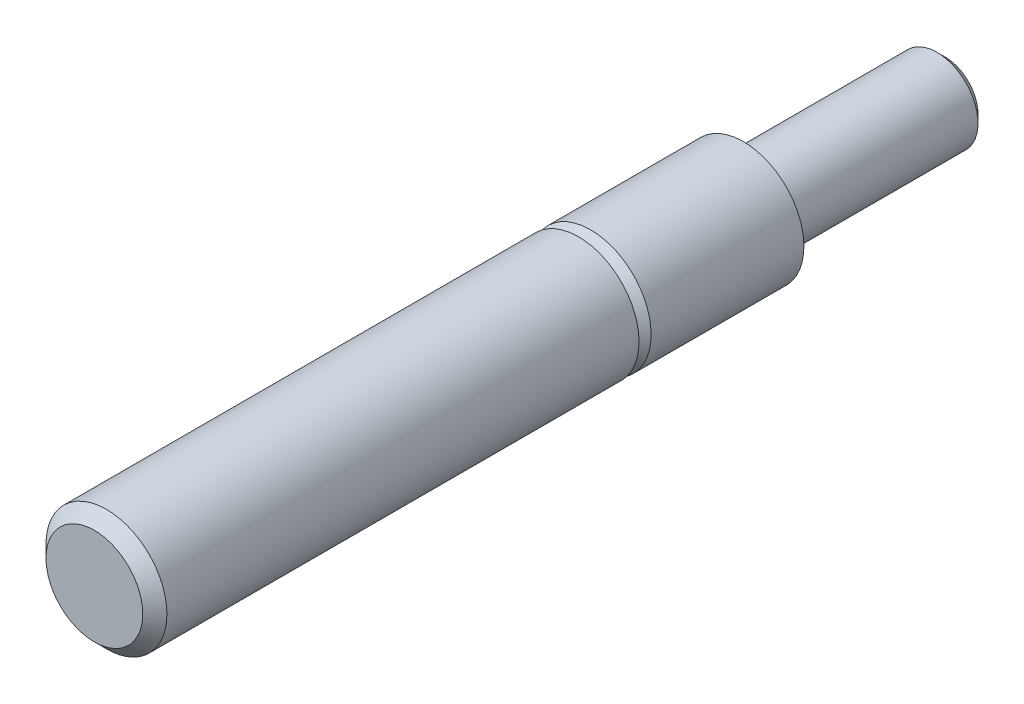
ISO-10303-21;
HEADER;
FILE_DESCRIPTION(('STEP AP214'),'2;1');
FILE_NAME('part.step','',(''),(''),'','','');
FILE_SCHEMA(('AUTOMOTIVE_DESIGN { 1 0 10303 214 1 1 1 1 }'));
ENDSEC;
DATA;
#1=APPLICATION_CONTEXT('core data for automotive mechanical design processes');
#2=APPLICATION_PROTOCOL_DEFINITION('international standard','automotive_design',2000,#1);
#3=PRODUCT_CONTEXT('',#1,'mechanical');
#4=PRODUCT('Part','Part','',(#3));
#5=PRODUCT_RELATED_PRODUCT_CATEGORY('part','',(#4));
#6=PRODUCT_DEFINITION_FORMATION('','',#4);
#7=PRODUCT_DEFINITION_CONTEXT('part definition',#1,'design');
#8=PRODUCT_DEFINITION('design','',#6,#7);
#9=PRODUCT_DEFINITION_SHAPE('','',#8);
#10=(LENGTH_UNIT() NAMED_UNIT(*) SI_UNIT(.MILLI.,.METRE.));
#11=(NAMED_UNIT(*) PLANE_ANGLE_UNIT() SI_UNIT($,.RADIAN.));
#12=(NAMED_UNIT(*) SI_UNIT($,.STERADIAN.) SOLID_ANGLE_UNIT());
#13=UNCERTAINTY_MEASURE_WITH_UNIT(LENGTH_MEASURE(1.E-05),#10,'distance_accuracy_value','');
#14=(GEOMETRIC_REPRESENTATION_CONTEXT(3) GLOBAL_UNCERTAINTY_ASSIGNED_CONTEXT((#13)) GLOBAL_UNIT_ASSIGNED_CONTEXT((#10,
#11,#12)) REPRESENTATION_CONTEXT('',''));
#15=CARTESIAN_POINT('',(0.,0.,0.));
#16=DIRECTION('',(0.,0.,1.));
#17=DIRECTION('',(1.,0.,0.));
#18=AXIS2_PLACEMENT_3D('',#15,#16,#17);
#19=CARTESIAN_POINT('',(0.,0.,0.));
#20=DIRECTION('',(0.,0.,-1.));
#21=DIRECTION('',(-1.,0.,0.));
#22=AXIS2_PLACEMENT_3D('',#19,#20,#21);
#23=PLANE('',#22);
#24=CARTESIAN_POINT('',(0.,0.,0.));
#25=DIRECTION('',(0.,0.,1.));
#26=DIRECTION('',(1.,0.,0.));
#27=AXIS2_PLACEMENT_3D('',#24,#25,#26);
#28=CIRCLE('',#27,2.801112);
#29=CARTESIAN_POINT('',(2.801112,0.,0.));
#30=VERTEX_POINT('',#29);
#31=EDGE_CURVE('E10',#30,#30,#28,.T.);
#32=ORIENTED_EDGE('',*,*,#31,.T.);
#33=EDGE_LOOP('',(#32));
#34=FACE_BOUND('',#33,.T.);
#35=ADVANCED_FACE('F38',(#34),#23,.F.);
#36=CARTESIAN_POINT('',(0.,0.,-0.700277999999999));
#37=DIRECTION('',(0.,0.,-1.));
#38=DIRECTION('',(-1.,0.,0.));
#39=AXIS2_PLACEMENT_3D('',#36,#37,#38);
#40=CONICAL_SURFACE('',#39,3.50139,0.785398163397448);
#41=ORIENTED_EDGE('',*,*,#31,.F.);
#42=EDGE_LOOP('',(#41));
#43=FACE_BOUND('',#42,.T.);
#44=CARTESIAN_POINT('',(0.,0.,-0.700277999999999));
#45=DIRECTION('',(0.,0.,1.));
#46=DIRECTION('',(1.,0.,0.));
#47=AXIS2_PLACEMENT_3D('',#44,#45,#46);
#48=CIRCLE('',#47,3.50139);
#49=CARTESIAN_POINT('',(3.50139,0.,-0.700277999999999));
#50=VERTEX_POINT('',#49);
#51=EDGE_CURVE('E44',#50,#50,#48,.T.);
#52=ORIENTED_EDGE('',*,*,#51,.T.);
#53=EDGE_LOOP('',(#52));
#54=FACE_BOUND('',#53,.T.);
#55=ADVANCED_FACE('F88',(#43,#54),#40,.T.);
#56=CARTESIAN_POINT('',(0.,0.,0.));
#57=DIRECTION('',(0.,0.,1.));
#58=DIRECTION('',(1.,0.,0.));
#59=AXIS2_PLACEMENT_3D('',#56,#57,#58);
#60=CYLINDRICAL_SURFACE('',#59,3.50139);
#61=ORIENTED_EDGE('',*,*,#51,.F.);
#62=EDGE_LOOP('',(#61));
#63=FACE_BOUND('',#62,.T.);
#64=CARTESIAN_POINT('',(0.,0.,-28.0416));
#65=DIRECTION('',(0.,0.,1.));
#66=DIRECTION('',(1.,0.,0.));
#67=AXIS2_PLACEMENT_3D('',#64,#65,#66);
#68=CIRCLE('',#67,3.50139);
#69=CARTESIAN_POINT('',(3.50139,0.,-28.0416));
#70=VERTEX_POINT('',#69);
#71=EDGE_CURVE('E48',#70,#70,#68,.T.);
#72=ORIENTED_EDGE('',*,*,#71,.T.);
#73=EDGE_LOOP('',(#72));
#74=FACE_BOUND('',#73,.T.);
#75=ADVANCED_FACE('F92',(#63,#74),#60,.T.);
#76=CARTESIAN_POINT('',(0.,3.50139000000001,-28.0416));
#77=DIRECTION('',(0.,0.,1.));
#78=DIRECTION('',(1.,0.,0.));
#79=AXIS2_PLACEMENT_3D('',#76,#77,#78);
#80=PLANE('',#79);
#81=ORIENTED_EDGE('',*,*,#71,.F.);
#82=EDGE_LOOP('',(#81));
#83=FACE_BOUND('',#82,.T.);
#84=CARTESIAN_POINT('',(0.,0.,-28.0416));
#85=DIRECTION('',(0.,0.,1.));
#86=DIRECTION('',(1.,0.,0.));
#87=AXIS2_PLACEMENT_3D('',#84,#85,#86);
#88=CIRCLE('',#87,2.801112);
#89=CARTESIAN_POINT('',(2.801112,0.,-28.0416));
#90=VERTEX_POINT('',#89);
#91=EDGE_CURVE('E52',#90,#90,#88,.T.);
#92=ORIENTED_EDGE('',*,*,#91,.T.);
#93=EDGE_LOOP('',(#92));
#94=FACE_BOUND('',#93,.T.);
#95=ADVANCED_FACE('F97',(#83,#94),#80,.F.);
#96=CARTESIAN_POINT('',(0.,0.,-28.741878));
#97=DIRECTION('',(0.,0.,-1.));
#98=DIRECTION('',(-1.,0.,0.));
#99=AXIS2_PLACEMENT_3D('',#96,#97,#98);
#100=CONICAL_SURFACE('',#99,3.50139,0.785398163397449);
#101=ORIENTED_EDGE('',*,*,#91,.F.);
#102=EDGE_LOOP('',(#101));
#103=FACE_BOUND('',#102,.T.);
#104=CARTESIAN_POINT('',(0.,0.,-28.741878));
#105=DIRECTION('',(0.,0.,1.));
#106=DIRECTION('',(1.,0.,0.));
#107=AXIS2_PLACEMENT_3D('',#104,#105,#106);
#108=CIRCLE('',#107,3.50139);
#109=CARTESIAN_POINT('',(3.50139,0.,-28.741878));
#110=VERTEX_POINT('',#109);
#111=EDGE_CURVE('E57',#110,#110,#108,.T.);
#112=ORIENTED_EDGE('',*,*,#111,.T.);
#113=EDGE_LOOP('',(#112));
#114=FACE_BOUND('',#113,.T.);
#115=ADVANCED_FACE('F103',(#103,#114),#100,.T.);
#116=CARTESIAN_POINT('',(0.,0.,0.));
#117=DIRECTION('',(0.,0.,1.));
#118=DIRECTION('',(1.,0.,0.));
#119=AXIS2_PLACEMENT_3D('',#116,#117,#118);
#120=CYLINDRICAL_SURFACE('',#119,3.50139);
#121=ORIENTED_EDGE('',*,*,#111,.F.);
#122=EDGE_LOOP('',(#121));
#123=FACE_BOUND('',#122,.T.);
#124=CARTESIAN_POINT('',(0.,0.,-37.592));
#125=DIRECTION('',(0.,0.,1.));
#126=DIRECTION('',(1.,0.,0.));
#127=AXIS2_PLACEMENT_3D('',#124,#125,#126);
#128=CIRCLE('',#127,3.50139);
#129=CARTESIAN_POINT('',(3.50139,0.,-37.592));
#130=VERTEX_POINT('',#129);
#131=EDGE_CURVE('E60',#130,#130,#128,.T.);
#132=ORIENTED_EDGE('',*,*,#131,.T.);
#133=EDGE_LOOP('',(#132));
#134=FACE_BOUND('',#133,.T.);
#135=ADVANCED_FACE('F107',(#123,#134),#120,.T.);
#136=CARTESIAN_POINT('',(0.,3.50139000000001,-37.592));
#137=DIRECTION('',(0.,0.,1.));
#138=DIRECTION('',(1.,0.,0.));
#139=AXIS2_PLACEMENT_3D('',#136,#137,#138);
#140=PLANE('',#139);
#141=ORIENTED_EDGE('',*,*,#131,.F.);
#142=EDGE_LOOP('',(#141));
#143=FACE_BOUND('',#142,.T.);
#144=CARTESIAN_POINT('',(0.,0.,-37.592));
#145=DIRECTION('',(0.,0.,1.));
#146=DIRECTION('',(1.,0.,0.));
#147=AXIS2_PLACEMENT_3D('',#144,#145,#146);
#148=CIRCLE('',#147,2.13741);
#149=CARTESIAN_POINT('',(2.13741,0.,-37.592));
#150=VERTEX_POINT('',#149);
#151=EDGE_CURVE('E63',#150,#150,#148,.T.);
#152=ORIENTED_EDGE('',*,*,#151,.T.);
#153=EDGE_LOOP('',(#152));
#154=FACE_BOUND('',#153,.T.);
#155=ADVANCED_FACE('F111',(#143,#154),#140,.F.);
#156=CARTESIAN_POINT('',(0.,0.,-38.06698));
#157=DIRECTION('',(0.,0.,-1.));
#158=DIRECTION('',(-1.,0.,0.));
#159=AXIS2_PLACEMENT_3D('',#156,#157,#158);
#160=CONICAL_SURFACE('',#159,2.3749,0.463647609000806);
#161=ORIENTED_EDGE('',*,*,#151,.F.);
#162=EDGE_LOOP('',(#161));
#163=FACE_BOUND('',#162,.T.);
#164=CARTESIAN_POINT('',(0.,0.,-38.06698));
#165=DIRECTION('',(0.,0.,1.));
#166=DIRECTION('',(1.,0.,0.));
#167=AXIS2_PLACEMENT_3D('',#164,#165,#166);
#168=CIRCLE('',#167,2.3749);
#169=CARTESIAN_POINT('',(2.3749,0.,-38.06698));
#170=VERTEX_POINT('',#169);
#171=EDGE_CURVE('E66',#170,#170,#168,.T.);
#172=ORIENTED_EDGE('',*,*,#171,.T.);
#173=EDGE_LOOP('',(#172));
#174=FACE_BOUND('',#173,.T.);
#175=ADVANCED_FACE('F115',(#163,#174),#160,.T.);
#176=CARTESIAN_POINT('',(0.,0.,0.));
#177=DIRECTION('',(0.,0.,1.));
#178=DIRECTION('',(1.,0.,0.));
#179=AXIS2_PLACEMENT_3D('',#176,#177,#178);
#180=CYLINDRICAL_SURFACE('',#179,2.3749);
#181=ORIENTED_EDGE('',*,*,#171,.F.);
#182=EDGE_LOOP('',(#181));
#183=FACE_BOUND('',#182,.T.);
#184=CARTESIAN_POINT('',(0.,0.,-48.80102));
#185=DIRECTION('',(0.,0.,1.));
#186=DIRECTION('',(1.,0.,0.));
#187=AXIS2_PLACEMENT_3D('',#184,#185,#186);
#188=CIRCLE('',#187,2.3749);
#189=CARTESIAN_POINT('',(2.3749,0.,-48.80102));
#190=VERTEX_POINT('',#189);
#191=EDGE_CURVE('E69',#190,#190,#188,.T.);
#192=ORIENTED_EDGE('',*,*,#191,.T.);
#193=EDGE_LOOP('',(#192));
#194=FACE_BOUND('',#193,.T.);
#195=ADVANCED_FACE('F84',(#183,#194),#180,.T.);
#196=CARTESIAN_POINT('',(0.,0.,-49.276));
#197=DIRECTION('',(0.,0.,1.));
#198=DIRECTION('',(1.,0.,0.));
#199=AXIS2_PLACEMENT_3D('',#196,#197,#198);
#200=CONICAL_SURFACE('',#199,1.89992,0.785398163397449);
#201=ORIENTED_EDGE('',*,*,#191,.F.);
#202=EDGE_LOOP('',(#201));
#203=FACE_BOUND('',#202,.T.);
#204=CARTESIAN_POINT('',(0.,0.,-49.276));
#205=DIRECTION('',(0.,0.,1.));
#206=DIRECTION('',(1.,0.,0.));
#207=AXIS2_PLACEMENT_3D('',#204,#205,#206);
#208=CIRCLE('',#207,1.89992);
#209=CARTESIAN_POINT('',(1.89992,0.,-49.276));
#210=VERTEX_POINT('',#209);
#211=EDGE_CURVE('E72',#210,#210,#208,.T.);
#212=ORIENTED_EDGE('',*,*,#211,.T.);
#213=EDGE_LOOP('',(#212));
#214=FACE_BOUND('',#213,.T.);
#215=ADVANCED_FACE('F76',(#203,#214),#200,.T.);
#216=CARTESIAN_POINT('',(0.,1.89992000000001,-49.276));
#217=DIRECTION('',(0.,0.,1.));
#218=DIRECTION('',(1.,0.,0.));
#219=AXIS2_PLACEMENT_3D('',#216,#217,#218);
#220=PLANE('',#219);
#221=ORIENTED_EDGE('',*,*,#211,.F.);
#222=EDGE_LOOP('',(#221));
#223=FACE_BOUND('',#222,.T.);
#224=ADVANCED_FACE('F78',(#223),#220,.F.);
#225=CLOSED_SHELL('',(#35,#55,#75,#95,#115,#135,#155,#175,#195,#215,#224));
#226=MANIFOLD_SOLID_BREP('B2',#225);
#227=ADVANCED_BREP_SHAPE_REPRESENTATION('',(#18,#226),#14);
#228=SHAPE_DEFINITION_REPRESENTATION(#9,#227);
ENDSEC;
END-ISO-10303-21;
